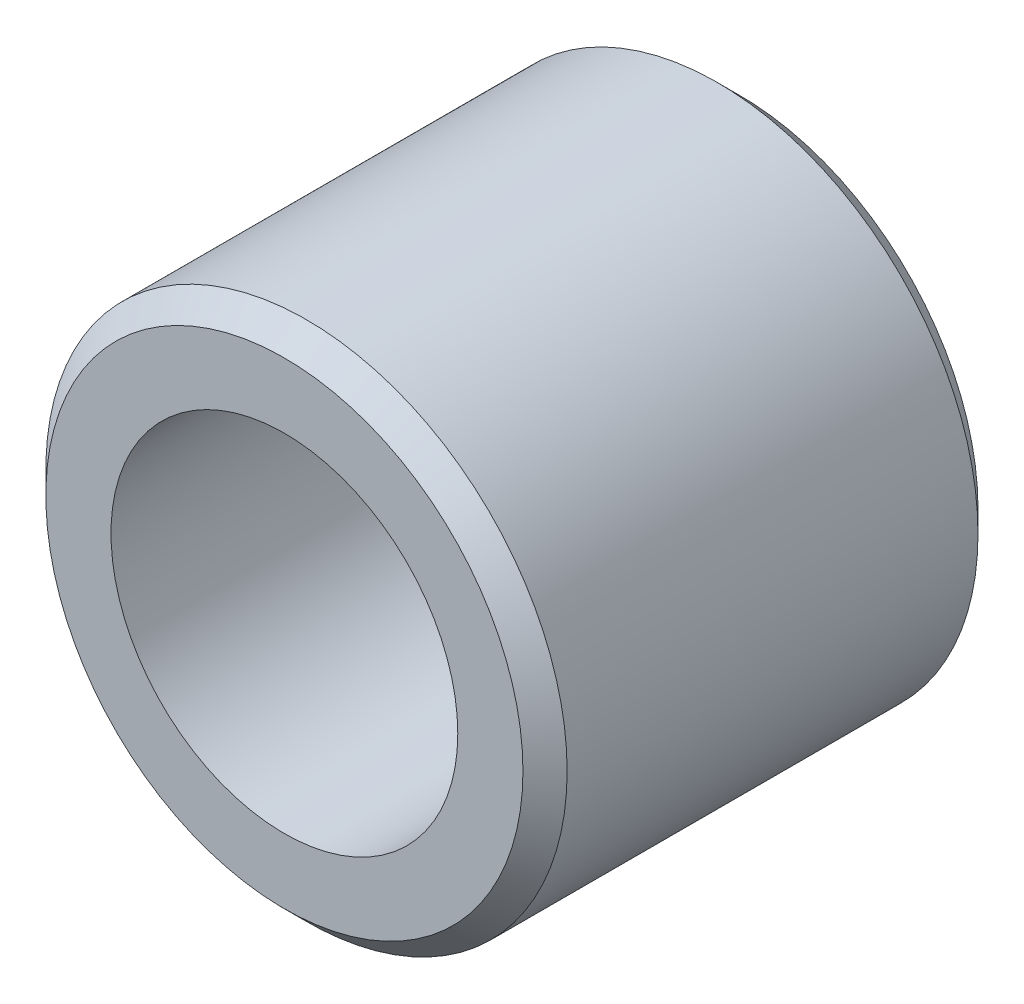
ISO-10303-21;
HEADER;
FILE_DESCRIPTION(('STEP AP214'),'2;1');
FILE_NAME('part.step','',(''),(''),'','','');
FILE_SCHEMA(('AUTOMOTIVE_DESIGN { 1 0 10303 214 1 1 1 1 }'));
ENDSEC;
DATA;
#1=APPLICATION_CONTEXT('core data for automotive mechanical design processes');
#2=APPLICATION_PROTOCOL_DEFINITION('international standard','automotive_design',2000,#1);
#3=PRODUCT_CONTEXT('',#1,'mechanical');
#4=PRODUCT('Part','Part','',(#3));
#5=PRODUCT_RELATED_PRODUCT_CATEGORY('part','',(#4));
#6=PRODUCT_DEFINITION_FORMATION('','',#4);
#7=PRODUCT_DEFINITION_CONTEXT('part definition',#1,'design');
#8=PRODUCT_DEFINITION('design','',#6,#7);
#9=PRODUCT_DEFINITION_SHAPE('','',#8);
#10=(LENGTH_UNIT() NAMED_UNIT(*) SI_UNIT(.MILLI.,.METRE.));
#11=(NAMED_UNIT(*) PLANE_ANGLE_UNIT() SI_UNIT($,.RADIAN.));
#12=(NAMED_UNIT(*) SI_UNIT($,.STERADIAN.) SOLID_ANGLE_UNIT());
#13=UNCERTAINTY_MEASURE_WITH_UNIT(LENGTH_MEASURE(1.E-05),#10,'distance_accuracy_value','');
#14=(GEOMETRIC_REPRESENTATION_CONTEXT(3) GLOBAL_UNCERTAINTY_ASSIGNED_CONTEXT((#13)) GLOBAL_UNIT_ASSIGNED_CONTEXT((#10,
#11,#12)) REPRESENTATION_CONTEXT('',''));
#15=CARTESIAN_POINT('',(0.,0.,0.));
#16=DIRECTION('',(0.,0.,1.));
#17=DIRECTION('',(1.,0.,0.));
#18=AXIS2_PLACEMENT_3D('',#15,#16,#17);
#19=CARTESIAN_POINT('',(0.,0.,5.2324));
#20=DIRECTION('',(0.,0.,1.));
#21=DIRECTION('',(1.,0.,0.));
#22=AXIS2_PLACEMENT_3D('',#19,#20,#21);
#23=PLANE('',#22);
#24=CARTESIAN_POINT('',(0.,0.,5.2324));
#25=DIRECTION('',(0.,0.,1.));
#26=DIRECTION('',(1.,0.,0.));
#27=AXIS2_PLACEMENT_3D('',#24,#25,#26);
#28=CIRCLE('',#27,2.7432);
#29=CARTESIAN_POINT('',(2.7432,0.,5.2324));
#30=VERTEX_POINT('',#29);
#31=EDGE_CURVE('E8',#30,#30,#28,.T.);
#32=ORIENTED_EDGE('',*,*,#31,.T.);
#33=EDGE_LOOP('',(#32));
#34=FACE_BOUND('',#33,.T.);
#35=CARTESIAN_POINT('',(0.,0.,5.2324));
#36=DIRECTION('',(0.,0.,1.));
#37=DIRECTION('',(1.,0.,0.));
#38=AXIS2_PLACEMENT_3D('',#35,#36,#37);
#39=CIRCLE('',#38,1.9939);
#40=CARTESIAN_POINT('',(1.9939,0.,5.2324));
#41=VERTEX_POINT('',#40);
#42=EDGE_CURVE('E32',#41,#41,#39,.T.);
#43=ORIENTED_EDGE('',*,*,#42,.F.);
#44=EDGE_LOOP('',(#43));
#45=FACE_BOUND('',#44,.T.);
#46=ADVANCED_FACE('F12',(#34,#45),#23,.T.);
#47=CARTESIAN_POINT('',(0.,0.,0.));
#48=DIRECTION('',(0.,0.,1.));
#49=DIRECTION('',(1.,0.,0.));
#50=AXIS2_PLACEMENT_3D('',#47,#48,#49);
#51=PLANE('',#50);
#52=CARTESIAN_POINT('',(0.,0.,0.));
#53=DIRECTION('',(0.,0.,1.));
#54=DIRECTION('',(1.,0.,0.));
#55=AXIS2_PLACEMENT_3D('',#52,#53,#54);
#56=CIRCLE('',#55,2.7432);
#57=CARTESIAN_POINT('',(2.7432,0.,0.));
#58=VERTEX_POINT('',#57);
#59=EDGE_CURVE('E19',#58,#58,#56,.F.);
#60=ORIENTED_EDGE('',*,*,#59,.T.);
#61=EDGE_LOOP('',(#60));
#62=FACE_BOUND('',#61,.T.);
#63=CARTESIAN_POINT('',(0.,0.,0.));
#64=DIRECTION('',(0.,0.,1.));
#65=DIRECTION('',(1.,0.,0.));
#66=AXIS2_PLACEMENT_3D('',#63,#64,#65);
#67=CIRCLE('',#66,1.9939);
#68=CARTESIAN_POINT('',(1.9939,0.,0.));
#69=VERTEX_POINT('',#68);
#70=EDGE_CURVE('E33',#69,#69,#67,.T.);
#71=ORIENTED_EDGE('',*,*,#70,.T.);
#72=EDGE_LOOP('',(#71));
#73=FACE_BOUND('',#72,.T.);
#74=ADVANCED_FACE('F43',(#62,#73),#51,.F.);
#75=CARTESIAN_POINT('',(0.,0.,5.2324));
#76=DIRECTION('',(0.,0.,-1.));
#77=DIRECTION('',(-1.,0.,0.));
#78=AXIS2_PLACEMENT_3D('',#75,#76,#77);
#79=CYLINDRICAL_SURFACE('',#78,2.9972);
#80=CARTESIAN_POINT('',(0.,0.,0.254));
#81=DIRECTION('',(0.,0.,1.));
#82=DIRECTION('',(1.,0.,0.));
#83=AXIS2_PLACEMENT_3D('',#80,#81,#82);
#84=CIRCLE('',#83,2.9972);
#85=CARTESIAN_POINT('',(2.9972,0.,0.254));
#86=VERTEX_POINT('',#85);
#87=EDGE_CURVE('E23',#86,#86,#84,.T.);
#88=ORIENTED_EDGE('',*,*,#87,.T.);
#89=EDGE_LOOP('',(#88));
#90=FACE_BOUND('',#89,.T.);
#91=CARTESIAN_POINT('',(0.,0.,4.9784));
#92=DIRECTION('',(0.,0.,1.));
#93=DIRECTION('',(1.,0.,0.));
#94=AXIS2_PLACEMENT_3D('',#91,#92,#93);
#95=CIRCLE('',#94,2.9972);
#96=CARTESIAN_POINT('',(2.9972,0.,4.9784));
#97=VERTEX_POINT('',#96);
#98=EDGE_CURVE('E27',#97,#97,#95,.F.);
#99=ORIENTED_EDGE('',*,*,#98,.T.);
#100=EDGE_LOOP('',(#99));
#101=FACE_BOUND('',#100,.T.);
#102=ADVANCED_FACE('F49',(#90,#101),#79,.T.);
#103=CARTESIAN_POINT('',(0.,0.,5.2324));
#104=DIRECTION('',(0.,0.,-1.));
#105=DIRECTION('',(-1.,0.,0.));
#106=AXIS2_PLACEMENT_3D('',#103,#104,#105);
#107=CYLINDRICAL_SURFACE('',#106,1.9939);
#108=ORIENTED_EDGE('',*,*,#42,.T.);
#109=EDGE_LOOP('',(#108));
#110=FACE_BOUND('',#109,.T.);
#111=ORIENTED_EDGE('',*,*,#70,.F.);
#112=EDGE_LOOP('',(#111));
#113=FACE_BOUND('',#112,.T.);
#114=ADVANCED_FACE('F39',(#110,#113),#107,.F.);
#115=CARTESIAN_POINT('',(0.,0.,0.254));
#116=DIRECTION('',(0.,0.,1.));
#117=DIRECTION('',(1.,0.,0.));
#118=AXIS2_PLACEMENT_3D('',#115,#116,#117);
#119=CONICAL_SURFACE('',#118,2.9972,0.785398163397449);
#120=ORIENTED_EDGE('',*,*,#59,.F.);
#121=EDGE_LOOP('',(#120));
#122=FACE_BOUND('',#121,.T.);
#123=ORIENTED_EDGE('',*,*,#87,.F.);
#124=EDGE_LOOP('',(#123));
#125=FACE_BOUND('',#124,.T.);
#126=ADVANCED_FACE('F55',(#122,#125),#119,.T.);
#127=CARTESIAN_POINT('',(0.,0.,5.2324));
#128=DIRECTION('',(0.,0.,-1.));
#129=DIRECTION('',(-1.,0.,0.));
#130=AXIS2_PLACEMENT_3D('',#127,#128,#129);
#131=CONICAL_SURFACE('',#130,2.7432,0.785398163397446);
#132=ORIENTED_EDGE('',*,*,#98,.F.);
#133=EDGE_LOOP('',(#132));
#134=FACE_BOUND('',#133,.T.);
#135=ORIENTED_EDGE('',*,*,#31,.F.);
#136=EDGE_LOOP('',(#135));
#137=FACE_BOUND('',#136,.T.);
#138=ADVANCED_FACE('F14',(#134,#137),#131,.T.);
#139=CLOSED_SHELL('',(#46,#74,#102,#114,#126,#138));
#140=MANIFOLD_SOLID_BREP('B1',#139);
#141=ADVANCED_BREP_SHAPE_REPRESENTATION('',(#18,#140),#14);
#142=SHAPE_DEFINITION_REPRESENTATION(#9,#141);
ENDSEC;
END-ISO-10303-21;
